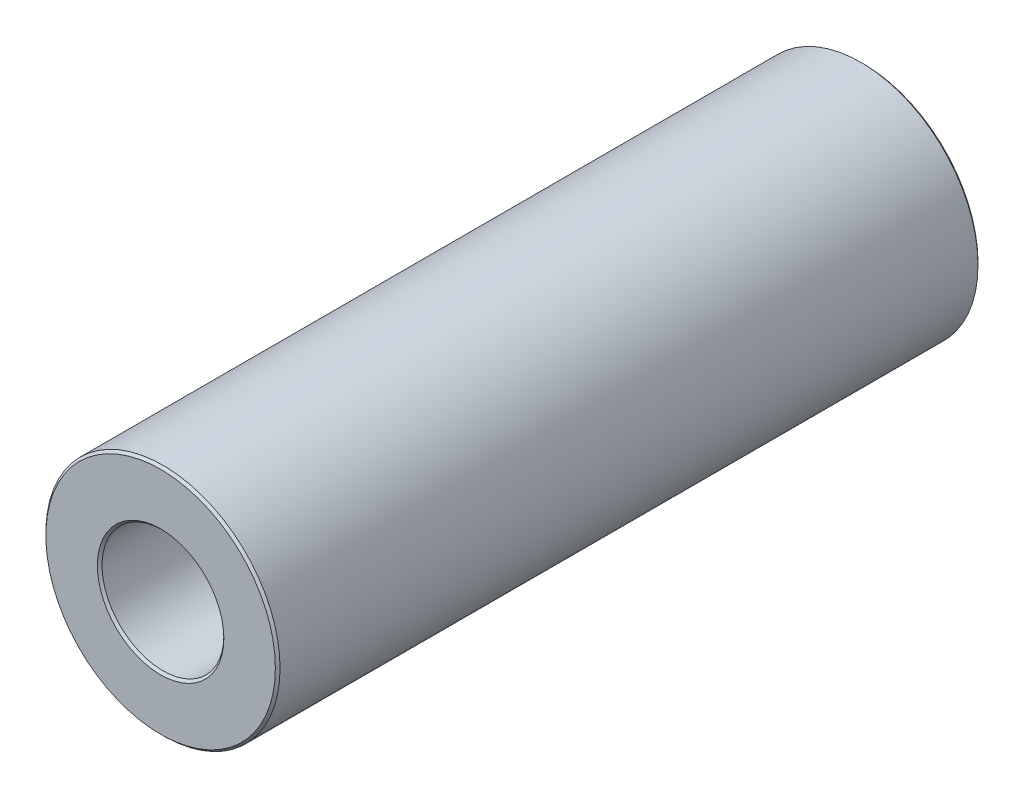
from build123d import *

# Parameters (mm, degrees)
SKETCH1_R           = 5
SKETCH1_R_2         = 2.6
BOSS_EXTRUDE2_DEPTH = 15
CHAMFER3_SIZE       = 0.1


with BuildPart() as part:
    # Sketch1 → Boss-Extrude2 (new, symmetric)
    with BuildSketch(Plane.XY):
        Circle(SKETCH1_R)
        Circle(SKETCH1_R_2, mode=Mode.SUBTRACT)
    extrude(amount=BOSS_EXTRUDE2_DEPTH, both=True)

    # Chamfer3
    chamfer3_edges = [part.edges().sort_by_distance(p)[0] for p in [
        (-5, 0, -15),
        (-5, 0, 15),
        (-2.6, 0, -15),
        (-2.6, 0, 15),
    ]]
    chamfer(chamfer3_edges, length=CHAMFER3_SIZE)


solid = part.part
